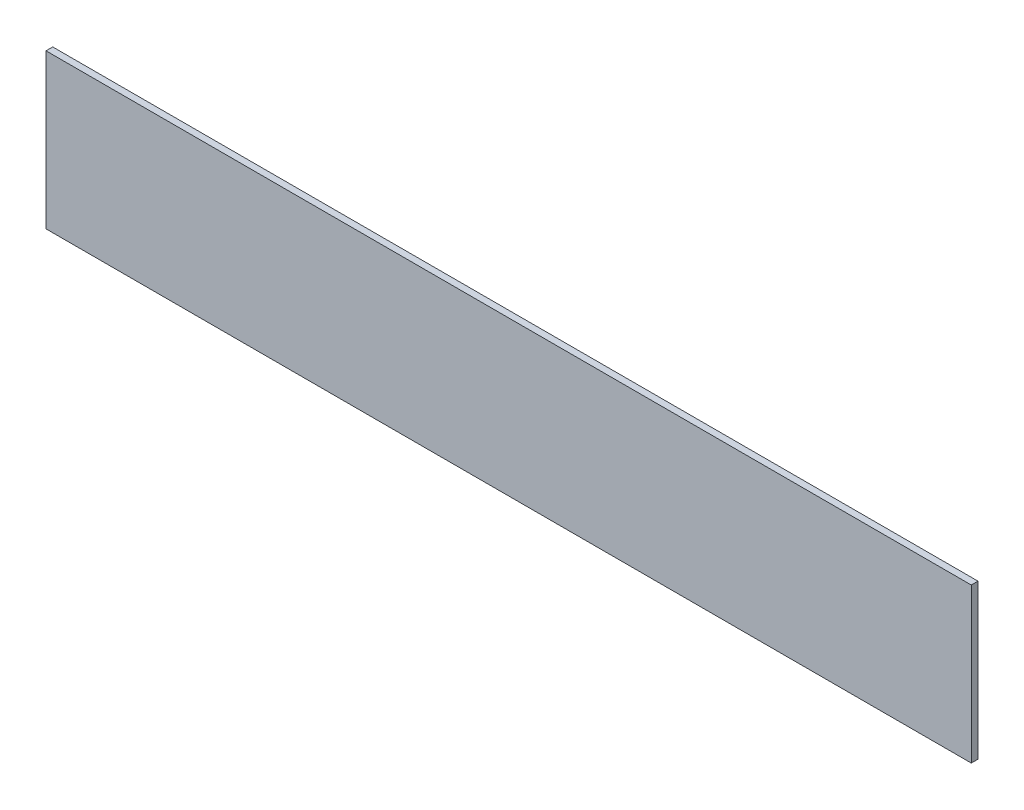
ISO-10303-21;
HEADER;
FILE_DESCRIPTION(('STEP AP214'),'2;1');
FILE_NAME('part.step','',(''),(''),'','','');
FILE_SCHEMA(('AUTOMOTIVE_DESIGN { 1 0 10303 214 1 1 1 1 }'));
ENDSEC;
DATA;
#1=APPLICATION_CONTEXT('core data for automotive mechanical design processes');
#2=APPLICATION_PROTOCOL_DEFINITION('international standard','automotive_design',2000,#1);
#3=PRODUCT_CONTEXT('',#1,'mechanical');
#4=PRODUCT('Part','Part','',(#3));
#5=PRODUCT_RELATED_PRODUCT_CATEGORY('part','',(#4));
#6=PRODUCT_DEFINITION_FORMATION('','',#4);
#7=PRODUCT_DEFINITION_CONTEXT('part definition',#1,'design');
#8=PRODUCT_DEFINITION('design','',#6,#7);
#9=PRODUCT_DEFINITION_SHAPE('','',#8);
#10=(LENGTH_UNIT() NAMED_UNIT(*) SI_UNIT(.MILLI.,.METRE.));
#11=(NAMED_UNIT(*) PLANE_ANGLE_UNIT() SI_UNIT($,.RADIAN.));
#12=(NAMED_UNIT(*) SI_UNIT($,.STERADIAN.) SOLID_ANGLE_UNIT());
#13=UNCERTAINTY_MEASURE_WITH_UNIT(LENGTH_MEASURE(1.E-05),#10,'distance_accuracy_value','');
#14=(GEOMETRIC_REPRESENTATION_CONTEXT(3) GLOBAL_UNCERTAINTY_ASSIGNED_CONTEXT((#13)) GLOBAL_UNIT_ASSIGNED_CONTEXT((#10,
#11,#12)) REPRESENTATION_CONTEXT('',''));
#15=CARTESIAN_POINT('',(0.,0.,0.));
#16=DIRECTION('',(0.,0.,1.));
#17=DIRECTION('',(1.,0.,0.));
#18=AXIS2_PLACEMENT_3D('',#15,#16,#17);
#19=CARTESIAN_POINT('',(17.8620495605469,20.85,-0.03048));
#20=DIRECTION('',(0.,-1.,0.));
#21=DIRECTION('',(0.,0.,-1.));
#22=AXIS2_PLACEMENT_3D('',#19,#20,#21);
#23=PLANE('',#22);
#24=DIRECTION('',(1.,0.,0.));
#25=VECTOR('',#24,1.);
#26=CARTESIAN_POINT('',(19.9620001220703,20.85,0.));
#27=LINE('',#26,#25);
#28=CARTESIAN_POINT('',(17.8620495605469,20.85,0.));
#29=VERTEX_POINT('',#28);
#30=CARTESIAN_POINT('',(22.0619506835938,20.85,0.));
#31=VERTEX_POINT('',#30);
#32=EDGE_CURVE('E74',#29,#31,#27,.T.);
#33=ORIENTED_EDGE('',*,*,#32,.T.);
#34=DIRECTION('',(0.,0.,-1.));
#35=VECTOR('',#34,1.);
#36=CARTESIAN_POINT('',(22.0619506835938,20.85,-0.01524));
#37=LINE('',#36,#35);
#38=CARTESIAN_POINT('',(22.0619506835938,20.85,-0.03048));
#39=VERTEX_POINT('',#38);
#40=EDGE_CURVE('E112',#31,#39,#37,.T.);
#41=ORIENTED_EDGE('',*,*,#40,.T.);
#42=DIRECTION('',(1.,0.,0.));
#43=VECTOR('',#42,1.);
#44=CARTESIAN_POINT('',(17.8620495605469,20.85,-0.03048));
#45=LINE('',#44,#43);
#46=CARTESIAN_POINT('',(17.8620495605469,20.85,-0.03048));
#47=VERTEX_POINT('',#46);
#48=EDGE_CURVE('E76',#47,#39,#45,.T.);
#49=ORIENTED_EDGE('',*,*,#48,.F.);
#50=DIRECTION('',(0.,0.,-1.));
#51=VECTOR('',#50,1.);
#52=CARTESIAN_POINT('',(17.8620495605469,20.85,-0.01524));
#53=LINE('',#52,#51);
#54=EDGE_CURVE('E11',#29,#47,#53,.T.);
#55=ORIENTED_EDGE('',*,*,#54,.F.);
#56=EDGE_LOOP('',(#33,#41,#49,#55));
#57=FACE_BOUND('',#56,.T.);
#58=ADVANCED_FACE('F17',(#57),#23,.F.);
#59=CARTESIAN_POINT('',(17.8620495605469,20.15,-0.03048));
#60=DIRECTION('',(1.,0.,0.));
#61=DIRECTION('',(0.,1.,0.));
#62=AXIS2_PLACEMENT_3D('',#59,#60,#61);
#63=PLANE('',#62);
#64=DIRECTION('',(0.,1.,0.));
#65=VECTOR('',#64,1.);
#66=CARTESIAN_POINT('',(17.8620495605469,20.5,0.));
#67=LINE('',#66,#65);
#68=CARTESIAN_POINT('',(17.8620495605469,20.15,0.));
#69=VERTEX_POINT('',#68);
#70=EDGE_CURVE('E80',#69,#29,#67,.T.);
#71=ORIENTED_EDGE('',*,*,#70,.T.);
#72=ORIENTED_EDGE('',*,*,#54,.T.);
#73=DIRECTION('',(0.,1.,0.));
#74=VECTOR('',#73,1.);
#75=CARTESIAN_POINT('',(17.8620495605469,20.15,-0.03048));
#76=LINE('',#75,#74);
#77=CARTESIAN_POINT('',(17.8620495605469,20.15,-0.03048));
#78=VERTEX_POINT('',#77);
#79=EDGE_CURVE('E105',#78,#47,#76,.T.);
#80=ORIENTED_EDGE('',*,*,#79,.F.);
#81=DIRECTION('',(0.,0.,-1.));
#82=VECTOR('',#81,1.);
#83=CARTESIAN_POINT('',(17.8620495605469,20.15,-0.01524));
#84=LINE('',#83,#82);
#85=EDGE_CURVE('E20',#69,#78,#84,.T.);
#86=ORIENTED_EDGE('',*,*,#85,.F.);
#87=EDGE_LOOP('',(#71,#72,#80,#86));
#88=FACE_BOUND('',#87,.T.);
#89=ADVANCED_FACE('F81',(#88),#63,.F.);
#90=CARTESIAN_POINT('',(22.0619506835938,20.15,-0.03048));
#91=DIRECTION('',(0.,1.,0.));
#92=DIRECTION('',(1.,0.,0.));
#93=AXIS2_PLACEMENT_3D('',#90,#91,#92);
#94=PLANE('',#93);
#95=DIRECTION('',(-1.,0.,0.));
#96=VECTOR('',#95,1.);
#97=CARTESIAN_POINT('',(19.9620001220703,20.15,0.));
#98=LINE('',#97,#96);
#99=CARTESIAN_POINT('',(22.0619506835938,20.15,0.));
#100=VERTEX_POINT('',#99);
#101=EDGE_CURVE('E85',#100,#69,#98,.T.);
#102=ORIENTED_EDGE('',*,*,#101,.T.);
#103=ORIENTED_EDGE('',*,*,#85,.T.);
#104=DIRECTION('',(-1.,0.,0.));
#105=VECTOR('',#104,1.);
#106=CARTESIAN_POINT('',(22.0619506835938,20.15,-0.03048));
#107=LINE('',#106,#105);
#108=CARTESIAN_POINT('',(22.0619506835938,20.15,-0.03048));
#109=VERTEX_POINT('',#108);
#110=EDGE_CURVE('E101',#109,#78,#107,.T.);
#111=ORIENTED_EDGE('',*,*,#110,.F.);
#112=DIRECTION('',(0.,0.,-1.));
#113=VECTOR('',#112,1.);
#114=CARTESIAN_POINT('',(22.0619506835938,20.15,-0.01524));
#115=LINE('',#114,#113);
#116=EDGE_CURVE('E47',#100,#109,#115,.T.);
#117=ORIENTED_EDGE('',*,*,#116,.F.);
#118=EDGE_LOOP('',(#102,#103,#111,#117));
#119=FACE_BOUND('',#118,.T.);
#120=ADVANCED_FACE('F142',(#119),#94,.F.);
#121=CARTESIAN_POINT('',(22.0619506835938,20.85,-0.03048));
#122=DIRECTION('',(-1.,0.,0.));
#123=DIRECTION('',(0.,0.,1.));
#124=AXIS2_PLACEMENT_3D('',#121,#122,#123);
#125=PLANE('',#124);
#126=DIRECTION('',(0.,-1.,0.));
#127=VECTOR('',#126,1.);
#128=CARTESIAN_POINT('',(22.0619506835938,20.5,0.));
#129=LINE('',#128,#127);
#130=EDGE_CURVE('E89',#31,#100,#129,.T.);
#131=ORIENTED_EDGE('',*,*,#130,.T.);
#132=ORIENTED_EDGE('',*,*,#116,.T.);
#133=DIRECTION('',(0.,-1.,0.));
#134=VECTOR('',#133,1.);
#135=CARTESIAN_POINT('',(22.0619506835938,20.85,-0.03048));
#136=LINE('',#135,#134);
#137=EDGE_CURVE('E99',#39,#109,#136,.T.);
#138=ORIENTED_EDGE('',*,*,#137,.F.);
#139=ORIENTED_EDGE('',*,*,#40,.F.);
#140=EDGE_LOOP('',(#131,#132,#138,#139));
#141=FACE_BOUND('',#140,.T.);
#142=ADVANCED_FACE('F133',(#141),#125,.F.);
#143=CARTESIAN_POINT('',(19.9620001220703,20.5,-0.03048));
#144=DIRECTION('',(0.,0.,1.));
#145=DIRECTION('',(1.,0.,0.));
#146=AXIS2_PLACEMENT_3D('',#143,#144,#145);
#147=PLANE('',#146);
#148=ORIENTED_EDGE('',*,*,#48,.T.);
#149=ORIENTED_EDGE('',*,*,#137,.T.);
#150=ORIENTED_EDGE('',*,*,#110,.T.);
#151=ORIENTED_EDGE('',*,*,#79,.T.);
#152=EDGE_LOOP('',(#148,#149,#150,#151));
#153=FACE_BOUND('',#152,.T.);
#154=ADVANCED_FACE('F124',(#153),#147,.F.);
#155=CARTESIAN_POINT('',(19.9620001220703,20.5,0.));
#156=DIRECTION('',(0.,0.,1.));
#157=DIRECTION('',(1.,0.,0.));
#158=AXIS2_PLACEMENT_3D('',#155,#156,#157);
#159=PLANE('',#158);
#160=ORIENTED_EDGE('',*,*,#32,.F.);
#161=ORIENTED_EDGE('',*,*,#70,.F.);
#162=ORIENTED_EDGE('',*,*,#101,.F.);
#163=ORIENTED_EDGE('',*,*,#130,.F.);
#164=EDGE_LOOP('',(#160,#161,#162,#163));
#165=FACE_BOUND('',#164,.T.);
#166=ADVANCED_FACE('F88',(#165),#159,.T.);
#167=CLOSED_SHELL('',(#58,#89,#120,#142,#154,#166));
#168=MANIFOLD_SOLID_BREP('B1',#167);
#169=ADVANCED_BREP_SHAPE_REPRESENTATION('',(#18,#168),#14);
#170=SHAPE_DEFINITION_REPRESENTATION(#9,#169);
ENDSEC;
END-ISO-10303-21;
